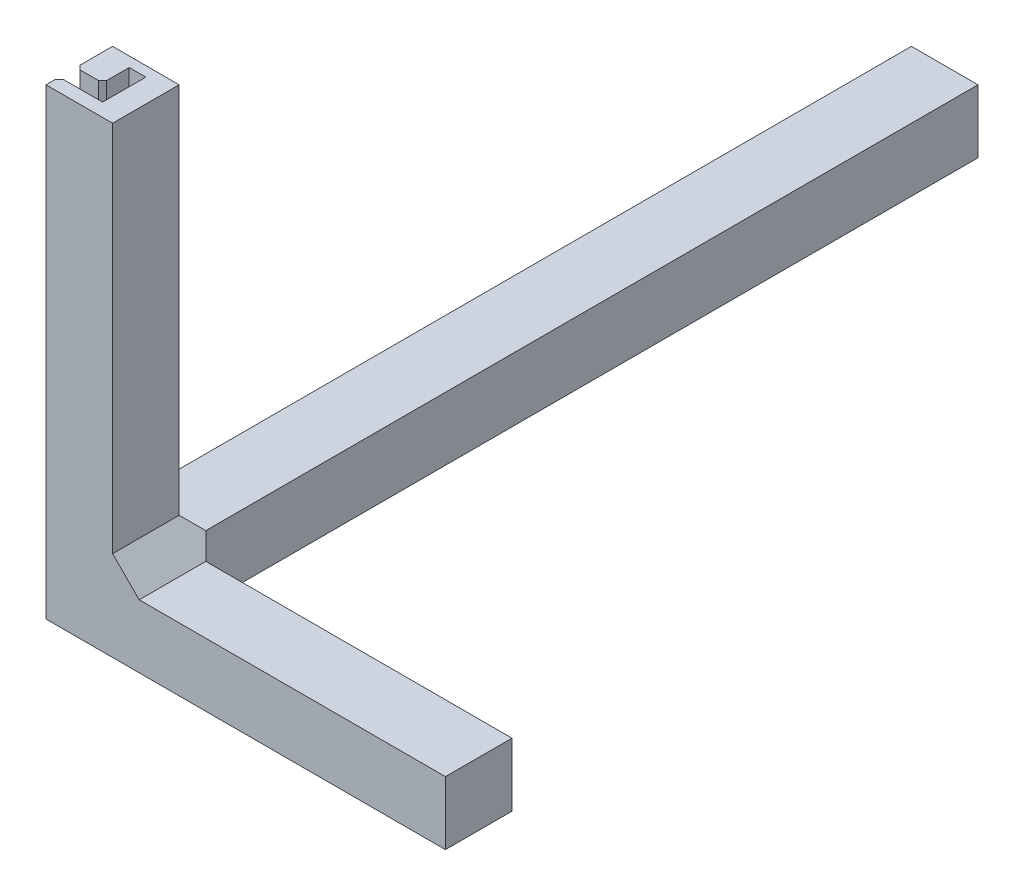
ISO-10303-21;
HEADER;
FILE_DESCRIPTION(('STEP AP214'),'2;1');
FILE_NAME('part.step','',(''),(''),'','','');
FILE_SCHEMA(('AUTOMOTIVE_DESIGN { 1 0 10303 214 1 1 1 1 }'));
ENDSEC;
DATA;
#1=APPLICATION_CONTEXT('core data for automotive mechanical design processes');
#2=APPLICATION_PROTOCOL_DEFINITION('international standard','automotive_design',2000,#1);
#3=PRODUCT_CONTEXT('',#1,'mechanical');
#4=PRODUCT('Part','Part','',(#3));
#5=PRODUCT_RELATED_PRODUCT_CATEGORY('part','',(#4));
#6=PRODUCT_DEFINITION_FORMATION('','',#4);
#7=PRODUCT_DEFINITION_CONTEXT('part definition',#1,'design');
#8=PRODUCT_DEFINITION('design','',#6,#7);
#9=PRODUCT_DEFINITION_SHAPE('','',#8);
#10=(LENGTH_UNIT() NAMED_UNIT(*) SI_UNIT(.MILLI.,.METRE.));
#11=(NAMED_UNIT(*) PLANE_ANGLE_UNIT() SI_UNIT($,.RADIAN.));
#12=(NAMED_UNIT(*) SI_UNIT($,.STERADIAN.) SOLID_ANGLE_UNIT());
#13=UNCERTAINTY_MEASURE_WITH_UNIT(LENGTH_MEASURE(1.E-05),#10,'distance_accuracy_value','');
#14=(GEOMETRIC_REPRESENTATION_CONTEXT(3) GLOBAL_UNCERTAINTY_ASSIGNED_CONTEXT((#13)) GLOBAL_UNIT_ASSIGNED_CONTEXT((#10,
#11,#12)) REPRESENTATION_CONTEXT('',''));
#15=CARTESIAN_POINT('',(0.,0.,0.));
#16=DIRECTION('',(0.,0.,1.));
#17=DIRECTION('',(1.,0.,0.));
#18=AXIS2_PLACEMENT_3D('',#15,#16,#17);
#19=CARTESIAN_POINT('',(50.,10.,0.));
#20=DIRECTION('',(0.,-1.,0.));
#21=DIRECTION('',(0.,0.,-1.));
#22=AXIS2_PLACEMENT_3D('',#19,#20,#21);
#23=PLANE('',#22);
#24=DIRECTION('',(0.,0.,1.));
#25=VECTOR('',#24,1.);
#26=CARTESIAN_POINT('',(-10.,10.,-10.));
#27=LINE('',#26,#25);
#28=CARTESIAN_POINT('',(-10.,10.,-130.));
#29=VERTEX_POINT('',#28);
#30=CARTESIAN_POINT('',(-10.,10.,-14.));
#31=VERTEX_POINT('',#30);
#32=EDGE_CURVE('E291',#29,#31,#27,.T.);
#33=ORIENTED_EDGE('',*,*,#32,.T.);
#34=DIRECTION('',(1.,0.,0.));
#35=VECTOR('',#34,1.);
#36=CARTESIAN_POINT('',(50.,10.,-14.));
#37=LINE('',#36,#35);
#38=CARTESIAN_POINT('',(0.,10.,-14.));
#39=VERTEX_POINT('',#38);
#40=EDGE_CURVE('E345',#31,#39,#37,.T.);
#41=ORIENTED_EDGE('',*,*,#40,.T.);
#42=DIRECTION('',(0.,0.,1.));
#43=VECTOR('',#42,1.);
#44=CARTESIAN_POINT('',(0.,10.,-10.));
#45=LINE('',#44,#43);
#46=CARTESIAN_POINT('',(0.,10.,-130.));
#47=VERTEX_POINT('',#46);
#48=EDGE_CURVE('E311',#47,#39,#45,.T.);
#49=ORIENTED_EDGE('',*,*,#48,.F.);
#50=DIRECTION('',(1.,0.,0.));
#51=VECTOR('',#50,1.);
#52=CARTESIAN_POINT('',(-10.,10.,-130.));
#53=LINE('',#52,#51);
#54=EDGE_CURVE('E308',#29,#47,#53,.T.);
#55=ORIENTED_EDGE('',*,*,#54,.F.);
#56=EDGE_LOOP('',(#33,#41,#49,#55));
#57=FACE_BOUND('',#56,.T.);
#58=ADVANCED_FACE('F41',(#57),#23,.F.);
#59=CARTESIAN_POINT('',(0.,0.,0.));
#60=DIRECTION('',(-1.,0.,0.));
#61=DIRECTION('',(0.,0.,1.));
#62=AXIS2_PLACEMENT_3D('',#59,#60,#61);
#63=PLANE('',#62);
#64=DIRECTION('',(0.,-1.,0.));
#65=VECTOR('',#64,1.);
#66=CARTESIAN_POINT('',(0.,0.,0.));
#67=LINE('',#66,#65);
#68=CARTESIAN_POINT('',(0.,70.,0.));
#69=VERTEX_POINT('',#68);
#70=CARTESIAN_POINT('',(0.,14.,0.));
#71=VERTEX_POINT('',#70);
#72=EDGE_CURVE('E292',#69,#71,#67,.T.);
#73=ORIENTED_EDGE('',*,*,#72,.T.);
#74=DIRECTION('',(0.,0.,-1.));
#75=VECTOR('',#74,1.);
#76=CARTESIAN_POINT('',(0.,14.,-10.));
#77=LINE('',#76,#75);
#78=CARTESIAN_POINT('',(0.,14.,-10.));
#79=VERTEX_POINT('',#78);
#80=EDGE_CURVE('E352',#71,#79,#77,.T.);
#81=ORIENTED_EDGE('',*,*,#80,.T.);
#82=DIRECTION('',(0.,1.,0.));
#83=VECTOR('',#82,1.);
#84=CARTESIAN_POINT('',(0.,70.,-10.));
#85=LINE('',#84,#83);
#86=CARTESIAN_POINT('',(0.,70.,-10.));
#87=VERTEX_POINT('',#86);
#88=EDGE_CURVE('E315',#79,#87,#85,.T.);
#89=ORIENTED_EDGE('',*,*,#88,.T.);
#90=DIRECTION('',(0.,0.,1.));
#91=VECTOR('',#90,1.);
#92=CARTESIAN_POINT('',(0.,70.,0.));
#93=LINE('',#92,#91);
#94=EDGE_CURVE('E318',#87,#69,#93,.T.);
#95=ORIENTED_EDGE('',*,*,#94,.T.);
#96=EDGE_LOOP('',(#73,#81,#89,#95));
#97=FACE_BOUND('',#96,.T.);
#98=ADVANCED_FACE('F563',(#97),#63,.F.);
#99=DIRECTION('',(0.,-1.,0.));
#100=VECTOR('',#99,1.);
#101=CARTESIAN_POINT('',(0.,0.,-14.));
#102=LINE('',#101,#100);
#103=CARTESIAN_POINT('',(0.,0.499999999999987,-14.));
#104=VERTEX_POINT('',#103);
#105=EDGE_CURVE('E338',#39,#104,#102,.T.);
#106=ORIENTED_EDGE('',*,*,#105,.T.);
#107=DIRECTION('',(0.,0.,-1.));
#108=VECTOR('',#107,1.);
#109=CARTESIAN_POINT('',(0.,0.499999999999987,-130.));
#110=LINE('',#109,#108);
#111=CARTESIAN_POINT('',(0.,0.499999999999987,-130.));
#112=VERTEX_POINT('',#111);
#113=EDGE_CURVE('E413',#104,#112,#110,.T.);
#114=ORIENTED_EDGE('',*,*,#113,.T.);
#115=DIRECTION('',(0.,1.,0.));
#116=VECTOR('',#115,1.);
#117=CARTESIAN_POINT('',(0.,10.,-130.));
#118=LINE('',#117,#116);
#119=EDGE_CURVE('E287',#112,#47,#118,.T.);
#120=ORIENTED_EDGE('',*,*,#119,.T.);
#121=ORIENTED_EDGE('',*,*,#48,.T.);
#122=EDGE_LOOP('',(#106,#114,#120,#121));
#123=FACE_BOUND('',#122,.T.);
#124=ADVANCED_FACE('F500',(#123),#63,.F.);
#125=CARTESIAN_POINT('',(-10.,0.,-130.));
#126=DIRECTION('',(0.,-1.,0.));
#127=DIRECTION('',(0.,0.,-1.));
#128=AXIS2_PLACEMENT_3D('',#125,#126,#127);
#129=PLANE('',#128);
#130=DIRECTION('',(0.,0.,-1.));
#131=VECTOR('',#130,1.);
#132=CARTESIAN_POINT('',(-9.50000000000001,0.,-130.));
#133=LINE('',#132,#131);
#134=CARTESIAN_POINT('',(-9.50000000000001,0.,-0.5));
#135=VERTEX_POINT('',#134);
#136=CARTESIAN_POINT('',(-9.50000000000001,0.,-129.5));
#137=VERTEX_POINT('',#136);
#138=EDGE_CURVE('E387',#135,#137,#133,.T.);
#139=ORIENTED_EDGE('',*,*,#138,.T.);
#140=DIRECTION('',(1.,0.,0.));
#141=VECTOR('',#140,1.);
#142=CARTESIAN_POINT('',(-10.,0.,-129.5));
#143=LINE('',#142,#141);
#144=CARTESIAN_POINT('',(-0.499999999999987,0.,-129.5));
#145=VERTEX_POINT('',#144);
#146=EDGE_CURVE('E390',#137,#145,#143,.T.);
#147=ORIENTED_EDGE('',*,*,#146,.T.);
#148=DIRECTION('',(0.,0.,1.));
#149=VECTOR('',#148,1.);
#150=CARTESIAN_POINT('',(-0.499999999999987,0.,-14.));
#151=LINE('',#150,#149);
#152=CARTESIAN_POINT('',(-0.499999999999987,0.,-13.7928932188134));
#153=VERTEX_POINT('',#152);
#154=EDGE_CURVE('E368',#145,#153,#151,.T.);
#155=ORIENTED_EDGE('',*,*,#154,.T.);
#156=DIRECTION('',(0.707106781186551,0.,0.707106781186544));
#157=VECTOR('',#156,1.);
#158=CARTESIAN_POINT('',(3.64644660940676,0.,-9.64644660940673));
#159=LINE('',#158,#157);
#160=CARTESIAN_POINT('',(3.79289321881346,0.,-9.50000000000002));
#161=VERTEX_POINT('',#160);
#162=EDGE_CURVE('E375',#153,#161,#159,.T.);
#163=ORIENTED_EDGE('',*,*,#162,.T.);
#164=DIRECTION('',(1.,0.,0.));
#165=VECTOR('',#164,1.);
#166=CARTESIAN_POINT('',(50.,0.,-9.50000000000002));
#167=LINE('',#166,#165);
#168=CARTESIAN_POINT('',(49.5,0.,-9.50000000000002));
#169=VERTEX_POINT('',#168);
#170=EDGE_CURVE('E378',#161,#169,#167,.T.);
#171=ORIENTED_EDGE('',*,*,#170,.T.);
#172=DIRECTION('',(0.,0.,1.));
#173=VECTOR('',#172,1.);
#174=CARTESIAN_POINT('',(49.5,0.,0.));
#175=LINE('',#174,#173);
#176=CARTESIAN_POINT('',(49.5,0.,-0.5));
#177=VERTEX_POINT('',#176);
#178=EDGE_CURVE('E381',#169,#177,#175,.T.);
#179=ORIENTED_EDGE('',*,*,#178,.T.);
#180=DIRECTION('',(-1.,0.,0.));
#181=VECTOR('',#180,1.);
#182=CARTESIAN_POINT('',(-10.,0.,-0.5));
#183=LINE('',#182,#181);
#184=EDGE_CURVE('E384',#177,#135,#183,.T.);
#185=ORIENTED_EDGE('',*,*,#184,.T.);
#186=EDGE_LOOP('',(#139,#147,#155,#163,#171,#179,#185));
#187=FACE_BOUND('',#186,.T.);
#188=ADVANCED_FACE('F570',(#187),#129,.T.);
#189=CARTESIAN_POINT('',(-10.,0.,0.));
#190=DIRECTION('',(0.,0.,1.));
#191=DIRECTION('',(1.,0.,0.));
#192=AXIS2_PLACEMENT_3D('',#189,#190,#191);
#193=PLANE('',#192);
#194=DIRECTION('',(0.,-1.,0.));
#195=VECTOR('',#194,1.);
#196=CARTESIAN_POINT('',(-10.,0.,0.));
#197=LINE('',#196,#195);
#198=CARTESIAN_POINT('',(-10.,70.,0.));
#199=VERTEX_POINT('',#198);
#200=CARTESIAN_POINT('',(-10.,0.499999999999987,0.));
#201=VERTEX_POINT('',#200);
#202=EDGE_CURVE('E304',#199,#201,#197,.T.);
#203=ORIENTED_EDGE('',*,*,#202,.T.);
#204=DIRECTION('',(1.,0.,0.));
#205=VECTOR('',#204,1.);
#206=CARTESIAN_POINT('',(-10.,0.499999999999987,0.));
#207=LINE('',#206,#205);
#208=CARTESIAN_POINT('',(50.,0.499999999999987,0.));
#209=VERTEX_POINT('',#208);
#210=EDGE_CURVE('E401',#201,#209,#207,.T.);
#211=ORIENTED_EDGE('',*,*,#210,.T.);
#212=DIRECTION('',(0.,-1.,0.));
#213=VECTOR('',#212,1.);
#214=CARTESIAN_POINT('',(50.,0.,0.));
#215=LINE('',#214,#213);
#216=CARTESIAN_POINT('',(50.,10.,0.));
#217=VERTEX_POINT('',#216);
#218=EDGE_CURVE('E268',#217,#209,#215,.T.);
#219=ORIENTED_EDGE('',*,*,#218,.F.);
#220=DIRECTION('',(-1.,0.,0.));
#221=VECTOR('',#220,1.);
#222=CARTESIAN_POINT('',(50.,10.,0.));
#223=LINE('',#222,#221);
#224=CARTESIAN_POINT('',(4.00000000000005,10.,0.));
#225=VERTEX_POINT('',#224);
#226=EDGE_CURVE('E279',#217,#225,#223,.T.);
#227=ORIENTED_EDGE('',*,*,#226,.T.);
#228=DIRECTION('',(0.707106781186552,-0.707106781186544,0.));
#229=VECTOR('',#228,1.);
#230=CARTESIAN_POINT('',(4.00000000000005,10.,0.));
#231=LINE('',#230,#229);
#232=EDGE_CURVE('E361',#225,#71,#231,.F.);
#233=ORIENTED_EDGE('',*,*,#232,.T.);
#234=ORIENTED_EDGE('',*,*,#72,.F.);
#235=DIRECTION('',(1.,0.,0.));
#236=VECTOR('',#235,1.);
#237=CARTESIAN_POINT('',(-10.,70.,0.));
#238=LINE('',#237,#236);
#239=EDGE_CURVE('E325',#199,#69,#238,.T.);
#240=ORIENTED_EDGE('',*,*,#239,.F.);
#241=EDGE_LOOP('',(#203,#211,#219,#227,#233,#234,#240));
#242=FACE_BOUND('',#241,.T.);
#243=ADVANCED_FACE('F534',(#242),#193,.T.);
#244=CARTESIAN_POINT('',(-10.,70.,0.));
#245=DIRECTION('',(0.,1.,0.));
#246=DIRECTION('',(0.,0.,1.));
#247=AXIS2_PLACEMENT_3D('',#244,#245,#246);
#248=PLANE('',#247);
#249=DIRECTION('',(1.,0.,0.));
#250=VECTOR('',#249,1.);
#251=CARTESIAN_POINT('',(-10.,70.,-2.));
#252=LINE('',#251,#250);
#253=CARTESIAN_POINT('',(-9.4,70.,-2.));
#254=VERTEX_POINT('',#253);
#255=CARTESIAN_POINT('',(-3.5,70.,-2.));
#256=VERTEX_POINT('',#255);
#257=EDGE_CURVE('E225',#254,#256,#252,.T.);
#258=ORIENTED_EDGE('',*,*,#257,.F.);
#259=DIRECTION('',(-0.707106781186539,0.,0.707106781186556));
#260=VECTOR('',#259,1.);
#261=CARTESIAN_POINT('',(-10.7,70.,-0.699999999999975));
#262=LINE('',#261,#260);
#263=CARTESIAN_POINT('',(-10.,70.,-1.39999999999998));
#264=VERTEX_POINT('',#263);
#265=EDGE_CURVE('E449',#254,#264,#262,.T.);
#266=ORIENTED_EDGE('',*,*,#265,.T.);
#267=DIRECTION('',(0.,0.,1.));
#268=VECTOR('',#267,1.);
#269=CARTESIAN_POINT('',(-10.,70.,0.));
#270=LINE('',#269,#268);
#271=EDGE_CURVE('E299',#264,#199,#270,.T.);
#272=ORIENTED_EDGE('',*,*,#271,.T.);
#273=ORIENTED_EDGE('',*,*,#239,.T.);
#274=ORIENTED_EDGE('',*,*,#94,.F.);
#275=DIRECTION('',(1.,0.,0.));
#276=VECTOR('',#275,1.);
#277=CARTESIAN_POINT('',(-10.,70.,-10.));
#278=LINE('',#277,#276);
#279=CARTESIAN_POINT('',(-10.,70.,-10.));
#280=VERTEX_POINT('',#279);
#281=EDGE_CURVE('E329',#280,#87,#278,.T.);
#282=ORIENTED_EDGE('',*,*,#281,.F.);
#283=CARTESIAN_POINT('',(-10.,70.,-5.09999999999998));
#284=VERTEX_POINT('',#283);
#285=EDGE_CURVE('E300',#280,#284,#270,.T.);
#286=ORIENTED_EDGE('',*,*,#285,.T.);
#287=DIRECTION('',(0.707106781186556,0.,0.707106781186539));
#288=VECTOR('',#287,1.);
#289=CARTESIAN_POINT('',(-7.45000000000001,70.,-2.55000000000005));
#290=LINE('',#289,#288);
#291=CARTESIAN_POINT('',(-9.40000000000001,70.,-4.5));
#292=VERTEX_POINT('',#291);
#293=EDGE_CURVE('E446',#284,#292,#290,.T.);
#294=ORIENTED_EDGE('',*,*,#293,.T.);
#295=DIRECTION('',(-1.,0.,0.));
#296=VECTOR('',#295,1.);
#297=CARTESIAN_POINT('',(-6.,70.,-4.5));
#298=LINE('',#297,#296);
#299=CARTESIAN_POINT('',(-6.59999999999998,70.,-4.5));
#300=VERTEX_POINT('',#299);
#301=EDGE_CURVE('E259',#300,#292,#298,.T.);
#302=ORIENTED_EDGE('',*,*,#301,.F.);
#303=DIRECTION('',(-0.707106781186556,0.,0.707106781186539));
#304=VECTOR('',#303,1.);
#305=CARTESIAN_POINT('',(-10.55,70.,-0.55000000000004));
#306=LINE('',#305,#304);
#307=CARTESIAN_POINT('',(-6.,70.,-5.09999999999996));
#308=VERTEX_POINT('',#307);
#309=EDGE_CURVE('E443',#300,#308,#306,.F.);
#310=ORIENTED_EDGE('',*,*,#309,.T.);
#311=DIRECTION('',(0.,0.,1.));
#312=VECTOR('',#311,1.);
#313=CARTESIAN_POINT('',(-6.,70.,-8.5));
#314=LINE('',#313,#312);
#315=CARTESIAN_POINT('',(-6.,70.,-8.5));
#316=VERTEX_POINT('',#315);
#317=EDGE_CURVE('E256',#316,#308,#314,.T.);
#318=ORIENTED_EDGE('',*,*,#317,.F.);
#319=DIRECTION('',(-1.,0.,0.));
#320=VECTOR('',#319,1.);
#321=CARTESIAN_POINT('',(-3.5,70.,-8.5));
#322=LINE('',#321,#320);
#323=CARTESIAN_POINT('',(-3.5,70.,-8.5));
#324=VERTEX_POINT('',#323);
#325=EDGE_CURVE('E252',#324,#316,#322,.T.);
#326=ORIENTED_EDGE('',*,*,#325,.F.);
#327=DIRECTION('',(0.,0.,-1.));
#328=VECTOR('',#327,1.);
#329=CARTESIAN_POINT('',(-3.5,70.,-2.));
#330=LINE('',#329,#328);
#331=EDGE_CURVE('E249',#256,#324,#330,.T.);
#332=ORIENTED_EDGE('',*,*,#331,.F.);
#333=EDGE_LOOP('',(#258,#266,#272,#273,#274,#282,#286,#294,#302,#310,#318,#326,#332));
#334=FACE_BOUND('',#333,.T.);
#335=ADVANCED_FACE('F482',(#334),#248,.T.);
#336=CARTESIAN_POINT('',(-10.,70.,-10.));
#337=DIRECTION('',(0.,0.,-1.));
#338=DIRECTION('',(0.,1.,0.));
#339=AXIS2_PLACEMENT_3D('',#336,#337,#338);
#340=PLANE('',#339);
#341=ORIENTED_EDGE('',*,*,#88,.F.);
#342=DIRECTION('',(-1.,0.,0.));
#343=VECTOR('',#342,1.);
#344=CARTESIAN_POINT('',(-10.,14.,-10.));
#345=LINE('',#344,#343);
#346=CARTESIAN_POINT('',(-10.,14.,-10.));
#347=VERTEX_POINT('',#346);
#348=EDGE_CURVE('E349',#79,#347,#345,.T.);
#349=ORIENTED_EDGE('',*,*,#348,.T.);
#350=DIRECTION('',(0.,1.,0.));
#351=VECTOR('',#350,1.);
#352=CARTESIAN_POINT('',(-10.,70.,-10.));
#353=LINE('',#352,#351);
#354=EDGE_CURVE('E296',#347,#280,#353,.T.);
#355=ORIENTED_EDGE('',*,*,#354,.T.);
#356=ORIENTED_EDGE('',*,*,#281,.T.);
#357=EDGE_LOOP('',(#341,#349,#355,#356));
#358=FACE_BOUND('',#357,.T.);
#359=ADVANCED_FACE('F487',(#358),#340,.T.);
#360=CARTESIAN_POINT('',(-10.,10.,-130.));
#361=DIRECTION('',(0.,0.,-1.));
#362=DIRECTION('',(-1.,0.,0.));
#363=AXIS2_PLACEMENT_3D('',#360,#361,#362);
#364=PLANE('',#363);
#365=ORIENTED_EDGE('',*,*,#119,.F.);
#366=DIRECTION('',(-1.,0.,0.));
#367=VECTOR('',#366,1.);
#368=CARTESIAN_POINT('',(-10.,0.499999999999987,-130.));
#369=LINE('',#368,#367);
#370=CARTESIAN_POINT('',(-10.,0.499999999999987,-130.));
#371=VERTEX_POINT('',#370);
#372=EDGE_CURVE('E394',#112,#371,#369,.T.);
#373=ORIENTED_EDGE('',*,*,#372,.T.);
#374=DIRECTION('',(0.,1.,0.));
#375=VECTOR('',#374,1.);
#376=CARTESIAN_POINT('',(-10.,10.,-130.));
#377=LINE('',#376,#375);
#378=EDGE_CURVE('E288',#371,#29,#377,.T.);
#379=ORIENTED_EDGE('',*,*,#378,.T.);
#380=ORIENTED_EDGE('',*,*,#54,.T.);
#381=EDGE_LOOP('',(#365,#373,#379,#380));
#382=FACE_BOUND('',#381,.T.);
#383=ADVANCED_FACE('F519',(#382),#364,.T.);
#384=CARTESIAN_POINT('',(-10.,0.,0.));
#385=DIRECTION('',(-1.,0.,0.));
#386=DIRECTION('',(0.,0.,1.));
#387=AXIS2_PLACEMENT_3D('',#384,#385,#386);
#388=PLANE('',#387);
#389=ORIENTED_EDGE('',*,*,#271,.F.);
#390=DIRECTION('',(0.,-1.,0.));
#391=VECTOR('',#390,1.);
#392=CARTESIAN_POINT('',(-10.,50.,-1.39999999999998));
#393=LINE('',#392,#391);
#394=CARTESIAN_POINT('',(-10.,50.,-1.39999999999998));
#395=VERTEX_POINT('',#394);
#396=EDGE_CURVE('E456',#264,#395,#393,.T.);
#397=ORIENTED_EDGE('',*,*,#396,.T.);
#398=DIRECTION('',(0.,0.,1.));
#399=VECTOR('',#398,1.);
#400=CARTESIAN_POINT('',(-10.,50.,-4.5));
#401=LINE('',#400,#399);
#402=CARTESIAN_POINT('',(-10.,50.,-5.09999999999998));
#403=VERTEX_POINT('',#402);
#404=EDGE_CURVE('E219',#403,#395,#401,.T.);
#405=ORIENTED_EDGE('',*,*,#404,.F.);
#406=DIRECTION('',(0.,1.,0.));
#407=VECTOR('',#406,1.);
#408=CARTESIAN_POINT('',(-10.,70.,-5.09999999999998));
#409=LINE('',#408,#407);
#410=EDGE_CURVE('E452',#403,#284,#409,.T.);
#411=ORIENTED_EDGE('',*,*,#410,.T.);
#412=ORIENTED_EDGE('',*,*,#285,.F.);
#413=ORIENTED_EDGE('',*,*,#354,.F.);
#414=DIRECTION('',(0.,-0.707106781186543,-0.707106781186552));
#415=VECTOR('',#414,1.);
#416=CARTESIAN_POINT('',(-10.,10.,-14.));
#417=LINE('',#416,#415);
#418=EDGE_CURVE('E358',#347,#31,#417,.T.);
#419=ORIENTED_EDGE('',*,*,#418,.T.);
#420=ORIENTED_EDGE('',*,*,#32,.F.);
#421=ORIENTED_EDGE('',*,*,#378,.F.);
#422=DIRECTION('',(0.,0.,1.));
#423=VECTOR('',#422,1.);
#424=CARTESIAN_POINT('',(-10.,0.499999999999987,0.));
#425=LINE('',#424,#423);
#426=EDGE_CURVE('E398',#371,#201,#425,.T.);
#427=ORIENTED_EDGE('',*,*,#426,.T.);
#428=ORIENTED_EDGE('',*,*,#202,.F.);
#429=EDGE_LOOP('',(#389,#397,#405,#411,#412,#413,#419,#420,#421,#427,#428));
#430=FACE_BOUND('',#429,.T.);
#431=ADVANCED_FACE('F478',(#430),#388,.T.);
#432=CARTESIAN_POINT('',(50.,0.,-10.));
#433=DIRECTION('',(0.,0.,1.));
#434=DIRECTION('',(1.,0.,0.));
#435=AXIS2_PLACEMENT_3D('',#432,#433,#434);
#436=PLANE('',#435);
#437=DIRECTION('',(0.,1.,0.));
#438=VECTOR('',#437,1.);
#439=CARTESIAN_POINT('',(50.,0.,-10.));
#440=LINE('',#439,#438);
#441=CARTESIAN_POINT('',(50.,0.499999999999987,-10.));
#442=VERTEX_POINT('',#441);
#443=CARTESIAN_POINT('',(50.,10.,-10.));
#444=VERTEX_POINT('',#443);
#445=EDGE_CURVE('E272',#442,#444,#440,.T.);
#446=ORIENTED_EDGE('',*,*,#445,.F.);
#447=DIRECTION('',(-1.,0.,0.));
#448=VECTOR('',#447,1.);
#449=CARTESIAN_POINT('',(4.00000000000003,0.499999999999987,-10.));
#450=LINE('',#449,#448);
#451=CARTESIAN_POINT('',(4.00000000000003,0.499999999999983,-10.));
#452=VERTEX_POINT('',#451);
#453=EDGE_CURVE('E407',#442,#452,#450,.T.);
#454=ORIENTED_EDGE('',*,*,#453,.T.);
#455=DIRECTION('',(0.,1.,0.));
#456=VECTOR('',#455,1.);
#457=CARTESIAN_POINT('',(4.00000000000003,10.,-10.));
#458=LINE('',#457,#456);
#459=CARTESIAN_POINT('',(4.00000000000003,10.,-10.));
#460=VERTEX_POINT('',#459);
#461=EDGE_CURVE('E328',#452,#460,#458,.T.);
#462=ORIENTED_EDGE('',*,*,#461,.T.);
#463=DIRECTION('',(-1.,0.,0.));
#464=VECTOR('',#463,1.);
#465=CARTESIAN_POINT('',(50.,10.,-10.));
#466=LINE('',#465,#464);
#467=EDGE_CURVE('E283',#444,#460,#466,.T.);
#468=ORIENTED_EDGE('',*,*,#467,.F.);
#469=EDGE_LOOP('',(#446,#454,#462,#468));
#470=FACE_BOUND('',#469,.T.);
#471=ADVANCED_FACE('F552',(#470),#436,.F.);
#472=ORIENTED_EDGE('',*,*,#467,.T.);
#473=DIRECTION('',(0.,0.,1.));
#474=VECTOR('',#473,1.);
#475=CARTESIAN_POINT('',(4.00000000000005,10.,0.));
#476=LINE('',#475,#474);
#477=EDGE_CURVE('E342',#460,#225,#476,.T.);
#478=ORIENTED_EDGE('',*,*,#477,.T.);
#479=ORIENTED_EDGE('',*,*,#226,.F.);
#480=DIRECTION('',(0.,0.,1.));
#481=VECTOR('',#480,1.);
#482=CARTESIAN_POINT('',(50.,10.,0.));
#483=LINE('',#482,#481);
#484=EDGE_CURVE('E276',#444,#217,#483,.T.);
#485=ORIENTED_EDGE('',*,*,#484,.F.);
#486=EDGE_LOOP('',(#472,#478,#479,#485));
#487=FACE_BOUND('',#486,.T.);
#488=ADVANCED_FACE('F557',(#487),#23,.F.);
#489=CARTESIAN_POINT('',(50.,0.,0.));
#490=DIRECTION('',(-1.,0.,0.));
#491=DIRECTION('',(0.,0.,1.));
#492=AXIS2_PLACEMENT_3D('',#489,#490,#491);
#493=PLANE('',#492);
#494=ORIENTED_EDGE('',*,*,#218,.T.);
#495=DIRECTION('',(0.,0.,-1.));
#496=VECTOR('',#495,1.);
#497=CARTESIAN_POINT('',(50.,0.499999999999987,-10.));
#498=LINE('',#497,#496);
#499=EDGE_CURVE('E404',#209,#442,#498,.T.);
#500=ORIENTED_EDGE('',*,*,#499,.T.);
#501=ORIENTED_EDGE('',*,*,#445,.T.);
#502=ORIENTED_EDGE('',*,*,#484,.T.);
#503=EDGE_LOOP('',(#494,#500,#501,#502));
#504=FACE_BOUND('',#503,.T.);
#505=ADVANCED_FACE('F549',(#504),#493,.F.);
#506=CARTESIAN_POINT('',(4.00000000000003,0.,-10.));
#507=DIRECTION('',(0.707106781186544,0.,-0.707106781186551));
#508=DIRECTION('',(0.,-1.,0.));
#509=AXIS2_PLACEMENT_3D('',#506,#507,#508);
#510=PLANE('',#509);
#511=ORIENTED_EDGE('',*,*,#461,.F.);
#512=DIRECTION('',(0.707106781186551,0.,0.707106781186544));
#513=VECTOR('',#512,1.);
#514=CARTESIAN_POINT('',(0.,0.499999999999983,-14.));
#515=LINE('',#514,#513);
#516=EDGE_CURVE('E410',#452,#104,#515,.F.);
#517=ORIENTED_EDGE('',*,*,#516,.T.);
#518=ORIENTED_EDGE('',*,*,#105,.F.);
#519=DIRECTION('',(-0.577350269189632,-0.577350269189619,-0.577350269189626));
#520=VECTOR('',#519,1.);
#521=CARTESIAN_POINT('',(-0.666666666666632,9.33333333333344,-14.6666666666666));
#522=LINE('',#521,#520);
#523=CARTESIAN_POINT('',(2.00000000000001,12.,-12.));
#524=VERTEX_POINT('',#523);
#525=EDGE_CURVE('E355',#39,#524,#522,.F.);
#526=ORIENTED_EDGE('',*,*,#525,.T.);
#527=DIRECTION('',(0.57735026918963,-0.577350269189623,0.577350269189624));
#528=VECTOR('',#527,1.);
#529=CARTESIAN_POINT('',(7.33333333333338,6.6666666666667,-6.66666666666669));
#530=LINE('',#529,#528);
#531=EDGE_CURVE('E364',#524,#460,#530,.T.);
#532=ORIENTED_EDGE('',*,*,#531,.T.);
#533=EDGE_LOOP('',(#511,#517,#518,#526,#532));
#534=FACE_BOUND('',#533,.T.);
#535=ADVANCED_FACE('F505',(#534),#510,.T.);
#536=CARTESIAN_POINT('',(4.00000000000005,10.,0.));
#537=DIRECTION('',(0.707106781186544,0.707106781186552,0.));
#538=DIRECTION('',(0.,0.,-1.));
#539=AXIS2_PLACEMENT_3D('',#536,#537,#538);
#540=PLANE('',#539);
#541=ORIENTED_EDGE('',*,*,#477,.F.);
#542=ORIENTED_EDGE('',*,*,#531,.F.);
#543=DIRECTION('',(-0.577350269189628,0.577350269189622,0.577350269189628));
#544=VECTOR('',#543,1.);
#545=CARTESIAN_POINT('',(19.3333333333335,-5.33333333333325,-29.3333333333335));
#546=LINE('',#545,#544);
#547=EDGE_CURVE('E273',#79,#524,#546,.F.);
#548=ORIENTED_EDGE('',*,*,#547,.F.);
#549=ORIENTED_EDGE('',*,*,#80,.F.);
#550=ORIENTED_EDGE('',*,*,#232,.F.);
#551=EDGE_LOOP('',(#541,#542,#548,#549,#550));
#552=FACE_BOUND('',#551,.T.);
#553=ADVANCED_FACE('F561',(#552),#540,.T.);
#554=CARTESIAN_POINT('',(50.,10.,-14.));
#555=DIRECTION('',(0.,-0.707106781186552,0.707106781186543));
#556=DIRECTION('',(1.,0.,0.));
#557=AXIS2_PLACEMENT_3D('',#554,#555,#556);
#558=PLANE('',#557);
#559=ORIENTED_EDGE('',*,*,#418,.F.);
#560=ORIENTED_EDGE('',*,*,#348,.F.);
#561=ORIENTED_EDGE('',*,*,#547,.T.);
#562=ORIENTED_EDGE('',*,*,#525,.F.);
#563=ORIENTED_EDGE('',*,*,#40,.F.);
#564=EDGE_LOOP('',(#559,#560,#561,#562,#563));
#565=FACE_BOUND('',#564,.T.);
#566=ADVANCED_FACE('F493',(#565),#558,.F.);
#567=CARTESIAN_POINT('',(50.,0.499999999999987,0.));
#568=DIRECTION('',(0.707106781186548,-0.707106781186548,0.));
#569=DIRECTION('',(0.,0.,1.));
#570=AXIS2_PLACEMENT_3D('',#567,#568,#569);
#571=PLANE('',#570);
#572=DIRECTION('',(0.57735026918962,0.57735026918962,0.577350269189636));
#573=VECTOR('',#572,1.);
#574=CARTESIAN_POINT('',(50.,0.499999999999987,0.));
#575=LINE('',#574,#573);
#576=EDGE_CURVE('E434',#177,#209,#575,.T.);
#577=ORIENTED_EDGE('',*,*,#576,.F.);
#578=ORIENTED_EDGE('',*,*,#178,.F.);
#579=DIRECTION('',(-0.577350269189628,-0.577350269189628,0.577350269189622));
#580=VECTOR('',#579,1.);
#581=CARTESIAN_POINT('',(50.,0.499999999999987,-10.));
#582=LINE('',#581,#580);
#583=EDGE_CURVE('E372',#442,#169,#582,.T.);
#584=ORIENTED_EDGE('',*,*,#583,.F.);
#585=ORIENTED_EDGE('',*,*,#499,.F.);
#586=EDGE_LOOP('',(#577,#578,#584,#585));
#587=FACE_BOUND('',#586,.T.);
#588=ADVANCED_FACE('F544',(#587),#571,.T.);
#589=CARTESIAN_POINT('',(50.,0.499999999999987,-10.));
#590=DIRECTION('',(0.,-0.707106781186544,-0.707106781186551));
#591=DIRECTION('',(1.,0.,0.));
#592=AXIS2_PLACEMENT_3D('',#589,#590,#591);
#593=PLANE('',#592);
#594=ORIENTED_EDGE('',*,*,#583,.T.);
#595=ORIENTED_EDGE('',*,*,#170,.F.);
#596=DIRECTION('',(0.281084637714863,0.678598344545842,-0.678598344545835));
#597=VECTOR('',#596,1.);
#598=CARTESIAN_POINT('',(7.63439438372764,9.27420421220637,-18.7742042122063));
#599=LINE('',#598,#597);
#600=EDGE_CURVE('E430',#452,#161,#599,.F.);
#601=ORIENTED_EDGE('',*,*,#600,.F.);
#602=ORIENTED_EDGE('',*,*,#453,.F.);
#603=EDGE_LOOP('',(#594,#595,#601,#602));
#604=FACE_BOUND('',#603,.T.);
#605=ADVANCED_FACE('F630',(#604),#593,.T.);
#606=CARTESIAN_POINT('',(-10.,0.499999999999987,0.));
#607=DIRECTION('',(0.,0.707106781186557,-0.707106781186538));
#608=DIRECTION('',(1.,0.,0.));
#609=AXIS2_PLACEMENT_3D('',#606,#607,#608);
#610=PLANE('',#609);
#611=ORIENTED_EDGE('',*,*,#576,.T.);
#612=ORIENTED_EDGE('',*,*,#210,.F.);
#613=DIRECTION('',(0.57735026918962,-0.57735026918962,-0.577350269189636));
#614=VECTOR('',#613,1.);
#615=CARTESIAN_POINT('',(-10.,0.499999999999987,0.));
#616=LINE('',#615,#614);
#617=EDGE_CURVE('E426',#135,#201,#616,.F.);
#618=ORIENTED_EDGE('',*,*,#617,.F.);
#619=ORIENTED_EDGE('',*,*,#184,.F.);
#620=EDGE_LOOP('',(#611,#612,#618,#619));
#621=FACE_BOUND('',#620,.T.);
#622=ADVANCED_FACE('F538',(#621),#610,.F.);
#623=CARTESIAN_POINT('',(-63.3535533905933,0.,-76.6464466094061));
#624=DIRECTION('',(-0.499999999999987,0.707106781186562,0.499999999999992));
#625=DIRECTION('',(0.707106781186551,0.,0.707106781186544));
#626=AXIS2_PLACEMENT_3D('',#623,#624,#625);
#627=PLANE('',#626);
#628=ORIENTED_EDGE('',*,*,#600,.T.);
#629=ORIENTED_EDGE('',*,*,#162,.F.);
#630=DIRECTION('',(0.678598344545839,0.678598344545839,-0.281084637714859));
#631=VECTOR('',#630,1.);
#632=CARTESIAN_POINT('',(-17.4548807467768,-16.9548807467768,-6.76995166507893));
#633=LINE('',#632,#631);
#634=EDGE_CURVE('E422',#104,#153,#633,.F.);
#635=ORIENTED_EDGE('',*,*,#634,.F.);
#636=ORIENTED_EDGE('',*,*,#516,.F.);
#637=EDGE_LOOP('',(#628,#629,#635,#636));
#638=FACE_BOUND('',#637,.T.);
#639=ADVANCED_FACE('F510',(#638),#627,.F.);
#640=CARTESIAN_POINT('',(-9.50000000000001,0.,-130.));
#641=DIRECTION('',(0.707106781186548,0.707106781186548,0.));
#642=DIRECTION('',(0.,0.,-1.));
#643=AXIS2_PLACEMENT_3D('',#640,#641,#642);
#644=PLANE('',#643);
#645=ORIENTED_EDGE('',*,*,#617,.T.);
#646=ORIENTED_EDGE('',*,*,#426,.F.);
#647=DIRECTION('',(0.57735026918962,-0.57735026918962,0.577350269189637));
#648=VECTOR('',#647,1.);
#649=CARTESIAN_POINT('',(-9.66666666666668,0.166666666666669,-129.666666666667));
#650=LINE('',#649,#648);
#651=EDGE_CURVE('E419',#137,#371,#650,.F.);
#652=ORIENTED_EDGE('',*,*,#651,.F.);
#653=ORIENTED_EDGE('',*,*,#138,.F.);
#654=EDGE_LOOP('',(#645,#646,#652,#653));
#655=FACE_BOUND('',#654,.T.);
#656=ADVANCED_FACE('F528',(#655),#644,.F.);
#657=CARTESIAN_POINT('',(0.,0.499999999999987,0.));
#658=DIRECTION('',(0.707106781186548,-0.707106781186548,0.));
#659=DIRECTION('',(0.,0.,1.));
#660=AXIS2_PLACEMENT_3D('',#657,#658,#659);
#661=PLANE('',#660);
#662=ORIENTED_EDGE('',*,*,#634,.T.);
#663=ORIENTED_EDGE('',*,*,#154,.F.);
#664=DIRECTION('',(-0.57735026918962,-0.57735026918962,0.577350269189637));
#665=VECTOR('',#664,1.);
#666=CARTESIAN_POINT('',(-43.3333333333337,-42.8333333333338,-86.666666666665));
#667=LINE('',#666,#665);
#668=EDGE_CURVE('E265',#112,#145,#667,.T.);
#669=ORIENTED_EDGE('',*,*,#668,.F.);
#670=ORIENTED_EDGE('',*,*,#113,.F.);
#671=EDGE_LOOP('',(#662,#663,#669,#670));
#672=FACE_BOUND('',#671,.T.);
#673=ADVANCED_FACE('F516',(#672),#661,.T.);
#674=CARTESIAN_POINT('',(-10.,0.,-129.5));
#675=DIRECTION('',(0.,0.707106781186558,0.707106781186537));
#676=DIRECTION('',(1.,0.,0.));
#677=AXIS2_PLACEMENT_3D('',#674,#675,#676);
#678=PLANE('',#677);
#679=ORIENTED_EDGE('',*,*,#651,.T.);
#680=ORIENTED_EDGE('',*,*,#372,.F.);
#681=ORIENTED_EDGE('',*,*,#668,.T.);
#682=ORIENTED_EDGE('',*,*,#146,.F.);
#683=EDGE_LOOP('',(#679,#680,#681,#682));
#684=FACE_BOUND('',#683,.T.);
#685=ADVANCED_FACE('F522',(#684),#678,.F.);
#686=CARTESIAN_POINT('',(-6.,50.,-4.5));
#687=DIRECTION('',(0.,0.,-1.));
#688=DIRECTION('',(-1.,0.,0.));
#689=AXIS2_PLACEMENT_3D('',#686,#687,#688);
#690=PLANE('',#689);
#691=ORIENTED_EDGE('',*,*,#301,.T.);
#692=DIRECTION('',(0.,-1.,0.));
#693=VECTOR('',#692,1.);
#694=CARTESIAN_POINT('',(-9.40000000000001,50.,-4.5));
#695=LINE('',#694,#693);
#696=CARTESIAN_POINT('',(-9.40000000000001,50.,-4.5));
#697=VERTEX_POINT('',#696);
#698=EDGE_CURVE('E66',#292,#697,#695,.T.);
#699=ORIENTED_EDGE('',*,*,#698,.T.);
#700=DIRECTION('',(-1.,0.,0.));
#701=VECTOR('',#700,1.);
#702=CARTESIAN_POINT('',(-6.,50.,-4.5));
#703=LINE('',#702,#701);
#704=CARTESIAN_POINT('',(-6.59999999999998,50.,-4.5));
#705=VERTEX_POINT('',#704);
#706=EDGE_CURVE('E231',#705,#697,#703,.T.);
#707=ORIENTED_EDGE('',*,*,#706,.F.);
#708=DIRECTION('',(0.,1.,0.));
#709=VECTOR('',#708,1.);
#710=CARTESIAN_POINT('',(-6.59999999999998,50.,-4.5));
#711=LINE('',#710,#709);
#712=EDGE_CURVE('E460',#705,#300,#711,.T.);
#713=ORIENTED_EDGE('',*,*,#712,.T.);
#714=EDGE_LOOP('',(#691,#699,#707,#713));
#715=FACE_BOUND('',#714,.T.);
#716=ADVANCED_FACE('F609',(#715),#690,.F.);
#717=CARTESIAN_POINT('',(-6.,50.,-8.5));
#718=DIRECTION('',(-1.,0.,0.));
#719=DIRECTION('',(0.,0.,1.));
#720=AXIS2_PLACEMENT_3D('',#717,#718,#719);
#721=PLANE('',#720);
#722=ORIENTED_EDGE('',*,*,#317,.T.);
#723=DIRECTION('',(0.,-1.,0.));
#724=VECTOR('',#723,1.);
#725=CARTESIAN_POINT('',(-6.,50.,-5.09999999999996));
#726=LINE('',#725,#724);
#727=CARTESIAN_POINT('',(-6.,50.,-5.09999999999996));
#728=VERTEX_POINT('',#727);
#729=EDGE_CURVE('E58',#308,#728,#726,.T.);
#730=ORIENTED_EDGE('',*,*,#729,.T.);
#731=DIRECTION('',(0.,0.,1.));
#732=VECTOR('',#731,1.);
#733=CARTESIAN_POINT('',(-6.,50.,-8.5));
#734=LINE('',#733,#732);
#735=CARTESIAN_POINT('',(-6.,50.,-8.5));
#736=VERTEX_POINT('',#735);
#737=EDGE_CURVE('E239',#736,#728,#734,.T.);
#738=ORIENTED_EDGE('',*,*,#737,.F.);
#739=DIRECTION('',(0.,1.,0.));
#740=VECTOR('',#739,1.);
#741=CARTESIAN_POINT('',(-6.,50.,-8.5));
#742=LINE('',#741,#740);
#743=EDGE_CURVE('E262',#736,#316,#742,.T.);
#744=ORIENTED_EDGE('',*,*,#743,.T.);
#745=EDGE_LOOP('',(#722,#730,#738,#744));
#746=FACE_BOUND('',#745,.T.);
#747=ADVANCED_FACE('F659',(#746),#721,.F.);
#748=CARTESIAN_POINT('',(-3.5,50.,-8.5));
#749=DIRECTION('',(0.,0.,-1.));
#750=DIRECTION('',(-1.,0.,0.));
#751=AXIS2_PLACEMENT_3D('',#748,#749,#750);
#752=PLANE('',#751);
#753=ORIENTED_EDGE('',*,*,#325,.T.);
#754=ORIENTED_EDGE('',*,*,#743,.F.);
#755=DIRECTION('',(-1.,0.,0.));
#756=VECTOR('',#755,1.);
#757=CARTESIAN_POINT('',(-3.5,50.,-8.5));
#758=LINE('',#757,#756);
#759=CARTESIAN_POINT('',(-3.5,50.,-8.5));
#760=VERTEX_POINT('',#759);
#761=EDGE_CURVE('E236',#760,#736,#758,.T.);
#762=ORIENTED_EDGE('',*,*,#761,.F.);
#763=DIRECTION('',(0.,1.,0.));
#764=VECTOR('',#763,1.);
#765=CARTESIAN_POINT('',(-3.5,50.,-8.5));
#766=LINE('',#765,#764);
#767=EDGE_CURVE('E230',#760,#324,#766,.T.);
#768=ORIENTED_EDGE('',*,*,#767,.T.);
#769=EDGE_LOOP('',(#753,#754,#762,#768));
#770=FACE_BOUND('',#769,.T.);
#771=ADVANCED_FACE('F661',(#770),#752,.F.);
#772=CARTESIAN_POINT('',(-3.5,50.,-2.));
#773=DIRECTION('',(1.,0.,0.));
#774=DIRECTION('',(0.,0.,-1.));
#775=AXIS2_PLACEMENT_3D('',#772,#773,#774);
#776=PLANE('',#775);
#777=ORIENTED_EDGE('',*,*,#331,.T.);
#778=ORIENTED_EDGE('',*,*,#767,.F.);
#779=DIRECTION('',(0.,0.,-1.));
#780=VECTOR('',#779,1.);
#781=CARTESIAN_POINT('',(-3.5,50.,-2.));
#782=LINE('',#781,#780);
#783=CARTESIAN_POINT('',(-3.5,50.,-2.));
#784=VERTEX_POINT('',#783);
#785=EDGE_CURVE('E212',#784,#760,#782,.T.);
#786=ORIENTED_EDGE('',*,*,#785,.F.);
#787=DIRECTION('',(0.,1.,0.));
#788=VECTOR('',#787,1.);
#789=CARTESIAN_POINT('',(-3.5,50.,-2.));
#790=LINE('',#789,#788);
#791=EDGE_CURVE('E222',#784,#256,#790,.T.);
#792=ORIENTED_EDGE('',*,*,#791,.T.);
#793=EDGE_LOOP('',(#777,#778,#786,#792));
#794=FACE_BOUND('',#793,.T.);
#795=ADVANCED_FACE('F233',(#794),#776,.F.);
#796=CARTESIAN_POINT('',(-10.,50.,-2.));
#797=DIRECTION('',(0.,0.,1.));
#798=DIRECTION('',(1.,0.,0.));
#799=AXIS2_PLACEMENT_3D('',#796,#797,#798);
#800=PLANE('',#799);
#801=DIRECTION('',(1.,0.,0.));
#802=VECTOR('',#801,1.);
#803=CARTESIAN_POINT('',(-10.,50.,-2.));
#804=LINE('',#803,#802);
#805=CARTESIAN_POINT('',(-9.4,50.,-2.));
#806=VERTEX_POINT('',#805);
#807=EDGE_CURVE('E207',#806,#784,#804,.T.);
#808=ORIENTED_EDGE('',*,*,#807,.F.);
#809=DIRECTION('',(0.,1.,0.));
#810=VECTOR('',#809,1.);
#811=CARTESIAN_POINT('',(-9.4,70.,-2.));
#812=LINE('',#811,#810);
#813=EDGE_CURVE('E416',#806,#254,#812,.T.);
#814=ORIENTED_EDGE('',*,*,#813,.T.);
#815=ORIENTED_EDGE('',*,*,#257,.T.);
#816=ORIENTED_EDGE('',*,*,#791,.F.);
#817=EDGE_LOOP('',(#808,#814,#815,#816));
#818=FACE_BOUND('',#817,.T.);
#819=ADVANCED_FACE('F223',(#818),#800,.F.);
#820=CARTESIAN_POINT('',(0.,50.,0.));
#821=DIRECTION('',(0.,1.,0.));
#822=DIRECTION('',(0.,0.,1.));
#823=AXIS2_PLACEMENT_3D('',#820,#821,#822);
#824=PLANE('',#823);
#825=ORIENTED_EDGE('',*,*,#404,.T.);
#826=DIRECTION('',(0.707106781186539,0.,-0.707106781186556));
#827=VECTOR('',#826,1.);
#828=CARTESIAN_POINT('',(-9.4,50.,-2.));
#829=LINE('',#828,#827);
#830=EDGE_CURVE('E214',#395,#806,#829,.T.);
#831=ORIENTED_EDGE('',*,*,#830,.T.);
#832=ORIENTED_EDGE('',*,*,#807,.T.);
#833=ORIENTED_EDGE('',*,*,#785,.T.);
#834=ORIENTED_EDGE('',*,*,#761,.T.);
#835=ORIENTED_EDGE('',*,*,#737,.T.);
#836=DIRECTION('',(0.707106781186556,0.,-0.707106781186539));
#837=VECTOR('',#836,1.);
#838=CARTESIAN_POINT('',(-6.59999999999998,50.,-4.5));
#839=LINE('',#838,#837);
#840=EDGE_CURVE('E11',#728,#705,#839,.F.);
#841=ORIENTED_EDGE('',*,*,#840,.T.);
#842=ORIENTED_EDGE('',*,*,#706,.T.);
#843=DIRECTION('',(-0.707106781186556,0.,-0.707106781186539));
#844=VECTOR('',#843,1.);
#845=CARTESIAN_POINT('',(-10.,50.,-5.09999999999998));
#846=LINE('',#845,#844);
#847=EDGE_CURVE('E51',#697,#403,#846,.T.);
#848=ORIENTED_EDGE('',*,*,#847,.T.);
#849=EDGE_LOOP('',(#825,#831,#832,#833,#834,#835,#841,#842,#848));
#850=FACE_BOUND('',#849,.T.);
#851=ADVANCED_FACE('F209',(#850),#824,.T.);
#852=CARTESIAN_POINT('',(-9.4,50.,-2.));
#853=DIRECTION('',(-0.707106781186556,0.,-0.707106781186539));
#854=DIRECTION('',(0.,-1.,0.));
#855=AXIS2_PLACEMENT_3D('',#852,#853,#854);
#856=PLANE('',#855);
#857=ORIENTED_EDGE('',*,*,#830,.F.);
#858=ORIENTED_EDGE('',*,*,#396,.F.);
#859=ORIENTED_EDGE('',*,*,#265,.F.);
#860=ORIENTED_EDGE('',*,*,#813,.F.);
#861=EDGE_LOOP('',(#857,#858,#859,#860));
#862=FACE_BOUND('',#861,.T.);
#863=ADVANCED_FACE('F640',(#862),#856,.T.);
#864=CARTESIAN_POINT('',(-10.,0.,-5.09999999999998));
#865=DIRECTION('',(-0.707106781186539,0.,0.707106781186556));
#866=DIRECTION('',(0.,-1.,0.));
#867=AXIS2_PLACEMENT_3D('',#864,#865,#866);
#868=PLANE('',#867);
#869=ORIENTED_EDGE('',*,*,#847,.F.);
#870=ORIENTED_EDGE('',*,*,#698,.F.);
#871=ORIENTED_EDGE('',*,*,#293,.F.);
#872=ORIENTED_EDGE('',*,*,#410,.F.);
#873=EDGE_LOOP('',(#869,#870,#871,#872));
#874=FACE_BOUND('',#873,.T.);
#875=ADVANCED_FACE('F474',(#874),#868,.T.);
#876=CARTESIAN_POINT('',(-6.59999999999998,50.,-4.5));
#877=DIRECTION('',(-0.707106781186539,0.,-0.707106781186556));
#878=DIRECTION('',(0.,1.,0.));
#879=AXIS2_PLACEMENT_3D('',#876,#877,#878);
#880=PLANE('',#879);
#881=ORIENTED_EDGE('',*,*,#840,.F.);
#882=ORIENTED_EDGE('',*,*,#729,.F.);
#883=ORIENTED_EDGE('',*,*,#309,.F.);
#884=ORIENTED_EDGE('',*,*,#712,.F.);
#885=EDGE_LOOP('',(#881,#882,#883,#884));
#886=FACE_BOUND('',#885,.T.);
#887=ADVANCED_FACE('F44',(#886),#880,.F.);
#888=CLOSED_SHELL('',(#58,#98,#124,#188,#243,#335,#359,#383,#431,#471,#488,#505,#535,#553,#566,
#588,#605,#622,#639,#656,#673,#685,#716,#747,#771,#795,#819,#851,#863,#875,#887));
#889=MANIFOLD_SOLID_BREP('B2',#888);
#890=ADVANCED_BREP_SHAPE_REPRESENTATION('',(#18,#889),#14);
#891=SHAPE_DEFINITION_REPRESENTATION(#9,#890);
ENDSEC;
END-ISO-10303-21;
